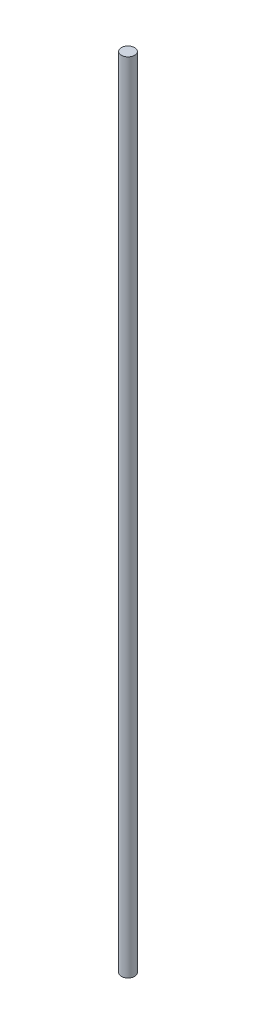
from build123d import *

# Parameters (mm, degrees)
SKETCH_1_R      = 2.5
EXTRUDE_1_DEPTH = 300


with BuildPart() as part:
    # Sketch 1 → Extrude 1 (new body)
    with BuildSketch(Plane(origin=(0, 0, 0), x_dir=(1, 0, 0), z_dir=(0, 1, 0))):
        with Locations(Location((0, 0, 0), (0, 0, 270))):
            Circle(SKETCH_1_R)
    extrude(amount=EXTRUDE_1_DEPTH)


solid = part.part
